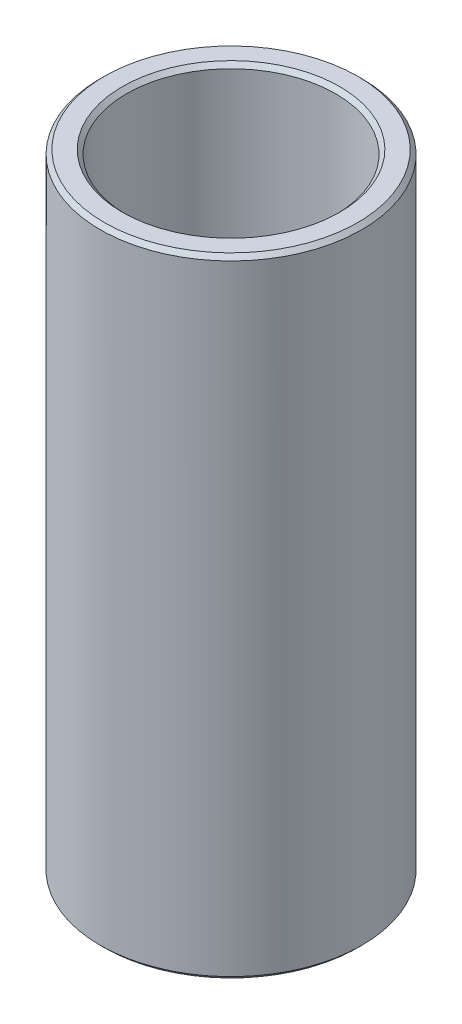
ISO-10303-21;
HEADER;
FILE_DESCRIPTION(('STEP AP214'),'2;1');
FILE_NAME('part.step','',(''),(''),'','','');
FILE_SCHEMA(('AUTOMOTIVE_DESIGN { 1 0 10303 214 1 1 1 1 }'));
ENDSEC;
DATA;
#1=APPLICATION_CONTEXT('core data for automotive mechanical design processes');
#2=APPLICATION_PROTOCOL_DEFINITION('international standard','automotive_design',2000,#1);
#3=PRODUCT_CONTEXT('',#1,'mechanical');
#4=PRODUCT('Part','Part','',(#3));
#5=PRODUCT_RELATED_PRODUCT_CATEGORY('part','',(#4));
#6=PRODUCT_DEFINITION_FORMATION('','',#4);
#7=PRODUCT_DEFINITION_CONTEXT('part definition',#1,'design');
#8=PRODUCT_DEFINITION('design','',#6,#7);
#9=PRODUCT_DEFINITION_SHAPE('','',#8);
#10=(LENGTH_UNIT() NAMED_UNIT(*) SI_UNIT(.MILLI.,.METRE.));
#11=(NAMED_UNIT(*) PLANE_ANGLE_UNIT() SI_UNIT($,.RADIAN.));
#12=(NAMED_UNIT(*) SI_UNIT($,.STERADIAN.) SOLID_ANGLE_UNIT());
#13=UNCERTAINTY_MEASURE_WITH_UNIT(LENGTH_MEASURE(1.E-05),#10,'distance_accuracy_value','');
#14=(GEOMETRIC_REPRESENTATION_CONTEXT(3) GLOBAL_UNCERTAINTY_ASSIGNED_CONTEXT((#13)) GLOBAL_UNIT_ASSIGNED_CONTEXT((#10,
#11,#12)) REPRESENTATION_CONTEXT('',''));
#15=CARTESIAN_POINT('',(0.,0.,0.));
#16=DIRECTION('',(0.,0.,1.));
#17=DIRECTION('',(1.,0.,0.));
#18=AXIS2_PLACEMENT_3D('',#15,#16,#17);
#19=CARTESIAN_POINT('',(0.,38.1,0.));
#20=DIRECTION('',(0.,1.,0.));
#21=DIRECTION('',(0.,0.,1.));
#22=AXIS2_PLACEMENT_3D('',#19,#20,#21);
#23=PLANE('',#22);
#24=CARTESIAN_POINT('',(0.,38.1,0.));
#25=DIRECTION('',(0.,1.,0.));
#26=DIRECTION('',(0.,0.,1.));
#27=AXIS2_PLACEMENT_3D('',#24,#25,#26);
#28=CIRCLE('',#27,6.60000000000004);
#29=CARTESIAN_POINT('',(0.,38.1,6.60000000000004));
#30=VERTEX_POINT('',#29);
#31=EDGE_CURVE('E10',#30,#30,#28,.F.);
#32=ORIENTED_EDGE('',*,*,#31,.T.);
#33=EDGE_LOOP('',(#32));
#34=FACE_BOUND('',#33,.T.);
#35=CARTESIAN_POINT('',(0.,38.1,0.));
#36=DIRECTION('',(0.,1.,0.));
#37=DIRECTION('',(0.,0.,1.));
#38=AXIS2_PLACEMENT_3D('',#35,#36,#37);
#39=CIRCLE('',#38,7.68750000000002);
#40=CARTESIAN_POINT('',(0.,38.1,7.68750000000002));
#41=VERTEX_POINT('',#40);
#42=EDGE_CURVE('E37',#41,#41,#39,.T.);
#43=ORIENTED_EDGE('',*,*,#42,.T.);
#44=EDGE_LOOP('',(#43));
#45=FACE_BOUND('',#44,.T.);
#46=ADVANCED_FACE('F30',(#34,#45),#23,.T.);
#47=CARTESIAN_POINT('',(0.,0.,0.));
#48=DIRECTION('',(0.,1.,0.));
#49=DIRECTION('',(0.,0.,1.));
#50=AXIS2_PLACEMENT_3D('',#47,#48,#49);
#51=PLANE('',#50);
#52=CARTESIAN_POINT('',(0.,0.,0.));
#53=DIRECTION('',(0.,1.,0.));
#54=DIRECTION('',(0.,0.,1.));
#55=AXIS2_PLACEMENT_3D('',#52,#53,#54);
#56=CIRCLE('',#55,6.59999999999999);
#57=CARTESIAN_POINT('',(0.,0.,6.59999999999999));
#58=VERTEX_POINT('',#57);
#59=EDGE_CURVE('E56',#58,#58,#56,.T.);
#60=ORIENTED_EDGE('',*,*,#59,.T.);
#61=EDGE_LOOP('',(#60));
#62=FACE_BOUND('',#61,.T.);
#63=CARTESIAN_POINT('',(0.,0.,0.));
#64=DIRECTION('',(0.,1.,0.));
#65=DIRECTION('',(0.,0.,1.));
#66=AXIS2_PLACEMENT_3D('',#63,#64,#65);
#67=CIRCLE('',#66,7.68749999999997);
#68=CARTESIAN_POINT('',(0.,0.,7.68749999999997));
#69=VERTEX_POINT('',#68);
#70=EDGE_CURVE('E59',#69,#69,#67,.F.);
#71=ORIENTED_EDGE('',*,*,#70,.T.);
#72=EDGE_LOOP('',(#71));
#73=FACE_BOUND('',#72,.T.);
#74=ADVANCED_FACE('F63',(#62,#73),#51,.F.);
#75=CARTESIAN_POINT('',(0.,38.1,0.));
#76=DIRECTION('',(0.,-1.,0.));
#77=DIRECTION('',(0.,0.,-1.));
#78=AXIS2_PLACEMENT_3D('',#75,#76,#77);
#79=CYLINDRICAL_SURFACE('',#78,7.9375);
#80=CARTESIAN_POINT('',(0.,0.250000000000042,0.));
#81=DIRECTION('',(0.,1.,0.));
#82=DIRECTION('',(0.,0.,1.));
#83=AXIS2_PLACEMENT_3D('',#80,#81,#82);
#84=CIRCLE('',#83,7.9375);
#85=CARTESIAN_POINT('',(0.,0.250000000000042,-7.9375));
#86=VERTEX_POINT('',#85);
#87=EDGE_CURVE('E41',#86,#86,#84,.T.);
#88=CARTESIAN_POINT('',(0.,37.85,0.));
#89=DIRECTION('',(0.,1.,0.));
#90=DIRECTION('',(0.,0.,1.));
#91=AXIS2_PLACEMENT_3D('',#88,#89,#90);
#92=CIRCLE('',#91,7.9375);
#93=CARTESIAN_POINT('',(0.,37.85,-7.9375));
#94=VERTEX_POINT('',#93);
#95=EDGE_CURVE('E45',#94,#94,#92,.F.);
#96=CARTESIAN_POINT('',(0.,0.250000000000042,-7.9375));
#97=CARTESIAN_POINT('',(0.,0.641666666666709,-7.9375));
#98=CARTESIAN_POINT('',(0.,1.03333333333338,-7.9375));
#99=CARTESIAN_POINT('',(0.,1.81666666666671,-7.9375));
#100=CARTESIAN_POINT('',(0.,2.20833333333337,-7.9375));
#101=CARTESIAN_POINT('',(0.,2.99166666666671,-7.9375));
#102=CARTESIAN_POINT('',(0.,3.38333333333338,-7.9375));
#103=CARTESIAN_POINT('',(0.,4.16666666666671,-7.9375));
#104=CARTESIAN_POINT('',(0.,4.55833333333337,-7.9375));
#105=CARTESIAN_POINT('',(0.,5.34166666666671,-7.9375));
#106=CARTESIAN_POINT('',(0.,5.73333333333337,-7.9375));
#107=CARTESIAN_POINT('',(0.,6.51666666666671,-7.9375));
#108=CARTESIAN_POINT('',(0.,6.90833333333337,-7.9375));
#109=CARTESIAN_POINT('',(0.,7.6916666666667,-7.9375));
#110=CARTESIAN_POINT('',(0.,8.08333333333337,-7.9375));
#111=CARTESIAN_POINT('',(0.,8.8666666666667,-7.9375));
#112=CARTESIAN_POINT('',(0.,9.25833333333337,-7.9375));
#113=CARTESIAN_POINT('',(0.,10.0416666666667,-7.9375));
#114=CARTESIAN_POINT('',(0.,10.4333333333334,-7.9375));
#115=CARTESIAN_POINT('',(0.,11.2166666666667,-7.9375));
#116=CARTESIAN_POINT('',(0.,11.6083333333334,-7.9375));
#117=CARTESIAN_POINT('',(0.,12.3916666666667,-7.9375));
#118=CARTESIAN_POINT('',(0.,12.7833333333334,-7.9375));
#119=CARTESIAN_POINT('',(0.,13.5666666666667,-7.9375));
#120=CARTESIAN_POINT('',(0.,13.9583333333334,-7.9375));
#121=CARTESIAN_POINT('',(0.,14.7416666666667,-7.9375));
#122=CARTESIAN_POINT('',(0.,15.1333333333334,-7.9375));
#123=CARTESIAN_POINT('',(0.,15.9166666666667,-7.9375));
#124=CARTESIAN_POINT('',(0.,16.3083333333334,-7.9375));
#125=CARTESIAN_POINT('',(0.,17.0916666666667,-7.9375));
#126=CARTESIAN_POINT('',(0.,17.4833333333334,-7.9375));
#127=CARTESIAN_POINT('',(0.,18.2666666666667,-7.9375));
#128=CARTESIAN_POINT('',(0.,18.6583333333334,-7.9375));
#129=CARTESIAN_POINT('',(0.,19.4416666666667,-7.9375));
#130=CARTESIAN_POINT('',(0.,19.8333333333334,-7.9375));
#131=CARTESIAN_POINT('',(0.,20.6166666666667,-7.9375));
#132=CARTESIAN_POINT('',(0.,21.0083333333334,-7.9375));
#133=CARTESIAN_POINT('',(0.,21.7916666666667,-7.9375));
#134=CARTESIAN_POINT('',(0.,22.1833333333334,-7.9375));
#135=CARTESIAN_POINT('',(0.,22.9666666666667,-7.9375));
#136=CARTESIAN_POINT('',(0.,23.3583333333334,-7.9375));
#137=CARTESIAN_POINT('',(0.,24.1416666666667,-7.9375));
#138=CARTESIAN_POINT('',(0.,24.5333333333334,-7.9375));
#139=CARTESIAN_POINT('',(0.,25.3166666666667,-7.9375));
#140=CARTESIAN_POINT('',(0.,25.7083333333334,-7.9375));
#141=CARTESIAN_POINT('',(0.,26.4916666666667,-7.9375));
#142=CARTESIAN_POINT('',(0.,26.8833333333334,-7.9375));
#143=CARTESIAN_POINT('',(0.,27.6666666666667,-7.9375));
#144=CARTESIAN_POINT('',(0.,28.0583333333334,-7.9375));
#145=CARTESIAN_POINT('',(0.,28.8416666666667,-7.9375));
#146=CARTESIAN_POINT('',(0.,29.2333333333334,-7.9375));
#147=CARTESIAN_POINT('',(0.,30.0166666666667,-7.9375));
#148=CARTESIAN_POINT('',(0.,30.4083333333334,-7.9375));
#149=CARTESIAN_POINT('',(0.,31.1916666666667,-7.9375));
#150=CARTESIAN_POINT('',(0.,31.5833333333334,-7.9375));
#151=CARTESIAN_POINT('',(0.,32.3666666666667,-7.9375));
#152=CARTESIAN_POINT('',(0.,32.7583333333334,-7.9375));
#153=CARTESIAN_POINT('',(0.,33.5416666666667,-7.9375));
#154=CARTESIAN_POINT('',(0.,33.9333333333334,-7.9375));
#155=CARTESIAN_POINT('',(0.,34.7166666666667,-7.9375));
#156=CARTESIAN_POINT('',(0.,35.1083333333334,-7.9375));
#157=CARTESIAN_POINT('',(0.,35.8916666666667,-7.9375));
#158=CARTESIAN_POINT('',(0.,36.2833333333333,-7.9375));
#159=CARTESIAN_POINT('',(0.,37.0666666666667,-7.9375));
#160=CARTESIAN_POINT('',(0.,37.4583333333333,-7.9375));
#161=CARTESIAN_POINT('',(0.,37.85,-7.9375));
#162=B_SPLINE_CURVE_WITH_KNOTS('',3,(#96,#97,#98,#99,#100,#101,#102,#103,#104,#105,#106,#107,
#108,#109,#110,#111,#112,#113,#114,#115,#116,#117,#118,#119,#120,#121,#122,#123,#124,#125,#126,
#127,#128,#129,#130,#131,#132,#133,#134,#135,#136,#137,#138,#139,#140,#141,#142,#143,#144,#145,
#146,#147,#148,#149,#150,#151,#152,#153,#154,#155,#156,#157,#158,#159,#160,#161),.UNSPECIFIED.,
.F.,.F.,(4,2,2,2,2,2,2,2,2,2,2,2,2,2,2,2,2,2,2,2,2,2,2,2,2,2,2,2,2,2,2,2,4),(0.,1.175,2.35,
3.525,4.7,5.875,7.04999999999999,8.22499999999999,9.39999999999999,10.575,11.75,12.925,14.1,
15.275,16.45,17.625,18.8,19.975,21.15,22.325,23.5,24.675,25.85,27.025,28.2,29.375,30.55,31.725,
32.9,34.075,35.25,36.425,37.6),.UNSPECIFIED.);
#163=EDGE_CURVE('BSEAM73',#86,#94,#162,.T.);
#164=ORIENTED_EDGE('',*,*,#87,.T.);
#165=ORIENTED_EDGE('',*,*,#95,.T.);
#166=ORIENTED_EDGE('',*,*,#163,.T.);
#167=ORIENTED_EDGE('',*,*,#163,.F.);
#168=EDGE_LOOP('',(#164,#166,#165,#167));
#169=FACE_BOUND('',#168,.T.);
#170=ADVANCED_FACE('F73',(#169),#79,.T.);
#171=CARTESIAN_POINT('',(0.,38.1,0.));
#172=DIRECTION('',(0.,-1.,0.));
#173=DIRECTION('',(0.,0.,-1.));
#174=AXIS2_PLACEMENT_3D('',#171,#172,#173);
#175=CYLINDRICAL_SURFACE('',#174,6.35);
#176=CARTESIAN_POINT('',(0.,0.249999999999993,0.));
#177=DIRECTION('',(0.,1.,0.));
#178=DIRECTION('',(0.,0.,1.));
#179=AXIS2_PLACEMENT_3D('',#176,#177,#178);
#180=CIRCLE('',#179,6.35);
#181=CARTESIAN_POINT('',(0.,0.249999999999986,-6.35));
#182=VERTEX_POINT('',#181);
#183=EDGE_CURVE('E50',#182,#182,#180,.F.);
#184=CARTESIAN_POINT('',(0.,37.85,0.));
#185=DIRECTION('',(0.,1.,0.));
#186=DIRECTION('',(0.,0.,1.));
#187=AXIS2_PLACEMENT_3D('',#184,#185,#186);
#188=CIRCLE('',#187,6.35);
#189=CARTESIAN_POINT('',(0.,37.85,-6.35));
#190=VERTEX_POINT('',#189);
#191=EDGE_CURVE('E53',#190,#190,#188,.T.);
#192=CARTESIAN_POINT('',(0.,0.249999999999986,-6.35));
#193=CARTESIAN_POINT('',(0.,0.641666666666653,-6.35));
#194=CARTESIAN_POINT('',(0.,1.03333333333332,-6.35));
#195=CARTESIAN_POINT('',(0.,1.81666666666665,-6.35));
#196=CARTESIAN_POINT('',(0.,2.20833333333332,-6.35));
#197=CARTESIAN_POINT('',(0.,2.99166666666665,-6.35));
#198=CARTESIAN_POINT('',(0.,3.38333333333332,-6.35));
#199=CARTESIAN_POINT('',(0.,4.16666666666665,-6.35));
#200=CARTESIAN_POINT('',(0.,4.55833333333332,-6.35));
#201=CARTESIAN_POINT('',(0.,5.34166666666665,-6.35));
#202=CARTESIAN_POINT('',(0.,5.73333333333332,-6.35));
#203=CARTESIAN_POINT('',(0.,6.51666666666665,-6.35));
#204=CARTESIAN_POINT('',(0.,6.90833333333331,-6.35));
#205=CARTESIAN_POINT('',(0.,7.69166666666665,-6.35));
#206=CARTESIAN_POINT('',(0.,8.08333333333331,-6.35));
#207=CARTESIAN_POINT('',(0.,8.86666666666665,-6.35));
#208=CARTESIAN_POINT('',(0.,9.25833333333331,-6.35));
#209=CARTESIAN_POINT('',(0.,10.0416666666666,-6.35));
#210=CARTESIAN_POINT('',(0.,10.4333333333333,-6.35));
#211=CARTESIAN_POINT('',(0.,11.2166666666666,-6.35));
#212=CARTESIAN_POINT('',(0.,11.6083333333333,-6.35));
#213=CARTESIAN_POINT('',(0.,12.3916666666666,-6.35));
#214=CARTESIAN_POINT('',(0.,12.7833333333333,-6.35));
#215=CARTESIAN_POINT('',(0.,13.5666666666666,-6.35));
#216=CARTESIAN_POINT('',(0.,13.9583333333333,-6.35));
#217=CARTESIAN_POINT('',(0.,14.7416666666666,-6.35));
#218=CARTESIAN_POINT('',(0.,15.1333333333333,-6.35));
#219=CARTESIAN_POINT('',(0.,15.9166666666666,-6.35));
#220=CARTESIAN_POINT('',(0.,16.3083333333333,-6.35));
#221=CARTESIAN_POINT('',(0.,17.0916666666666,-6.35));
#222=CARTESIAN_POINT('',(0.,17.4833333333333,-6.35));
#223=CARTESIAN_POINT('',(0.,18.2666666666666,-6.35));
#224=CARTESIAN_POINT('',(0.,18.6583333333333,-6.35));
#225=CARTESIAN_POINT('',(0.,19.4416666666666,-6.35));
#226=CARTESIAN_POINT('',(0.,19.8333333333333,-6.35));
#227=CARTESIAN_POINT('',(0.,20.6166666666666,-6.35));
#228=CARTESIAN_POINT('',(0.,21.0083333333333,-6.35));
#229=CARTESIAN_POINT('',(0.,21.7916666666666,-6.35));
#230=CARTESIAN_POINT('',(0.,22.1833333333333,-6.35));
#231=CARTESIAN_POINT('',(0.,22.9666666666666,-6.35));
#232=CARTESIAN_POINT('',(0.,23.3583333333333,-6.35));
#233=CARTESIAN_POINT('',(0.,24.1416666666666,-6.35));
#234=CARTESIAN_POINT('',(0.,24.5333333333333,-6.35));
#235=CARTESIAN_POINT('',(0.,25.3166666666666,-6.35));
#236=CARTESIAN_POINT('',(0.,25.7083333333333,-6.35));
#237=CARTESIAN_POINT('',(0.,26.4916666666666,-6.35));
#238=CARTESIAN_POINT('',(0.,26.8833333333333,-6.35));
#239=CARTESIAN_POINT('',(0.,27.6666666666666,-6.35));
#240=CARTESIAN_POINT('',(0.,28.0583333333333,-6.35));
#241=CARTESIAN_POINT('',(0.,28.8416666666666,-6.35));
#242=CARTESIAN_POINT('',(0.,29.2333333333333,-6.35));
#243=CARTESIAN_POINT('',(0.,30.0166666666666,-6.35));
#244=CARTESIAN_POINT('',(0.,30.4083333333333,-6.35));
#245=CARTESIAN_POINT('',(0.,31.1916666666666,-6.35));
#246=CARTESIAN_POINT('',(0.,31.5833333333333,-6.35));
#247=CARTESIAN_POINT('',(0.,32.3666666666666,-6.35));
#248=CARTESIAN_POINT('',(0.,32.7583333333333,-6.35));
#249=CARTESIAN_POINT('',(0.,33.5416666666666,-6.35));
#250=CARTESIAN_POINT('',(0.,33.9333333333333,-6.35));
#251=CARTESIAN_POINT('',(0.,34.7166666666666,-6.35));
#252=CARTESIAN_POINT('',(0.,35.1083333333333,-6.35));
#253=CARTESIAN_POINT('',(0.,35.8916666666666,-6.35));
#254=CARTESIAN_POINT('',(0.,36.2833333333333,-6.35));
#255=CARTESIAN_POINT('',(0.,37.0666666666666,-6.35));
#256=CARTESIAN_POINT('',(0.,37.4583333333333,-6.35));
#257=CARTESIAN_POINT('',(0.,37.85,-6.35));
#258=B_SPLINE_CURVE_WITH_KNOTS('',3,(#192,#193,#194,#195,#196,#197,#198,#199,#200,#201,#202,
#203,#204,#205,#206,#207,#208,#209,#210,#211,#212,#213,#214,#215,#216,#217,#218,#219,#220,#221,
#222,#223,#224,#225,#226,#227,#228,#229,#230,#231,#232,#233,#234,#235,#236,#237,#238,#239,#240,
#241,#242,#243,#244,#245,#246,#247,#248,#249,#250,#251,#252,#253,#254,#255,#256,#257),
.UNSPECIFIED.,.F.,.F.,(4,2,2,2,2,2,2,2,2,2,2,2,2,2,2,2,2,2,2,2,2,2,2,2,2,2,2,2,2,2,2,2,4),(0.,
1.175,2.35,3.525,4.7,5.875,7.04999999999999,8.22499999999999,9.39999999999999,10.575,11.75,
12.925,14.1,15.275,16.45,17.625,18.8,19.975,21.15,22.325,23.5,24.675,25.85,27.025,28.2,29.375,
30.55,31.725,32.9,34.075,35.25,36.425,37.6),.UNSPECIFIED.);
#259=EDGE_CURVE('BSEAM76',#182,#190,#258,.T.);
#260=ORIENTED_EDGE('',*,*,#183,.T.);
#261=ORIENTED_EDGE('',*,*,#191,.T.);
#262=ORIENTED_EDGE('',*,*,#259,.T.);
#263=ORIENTED_EDGE('',*,*,#259,.F.);
#264=EDGE_LOOP('',(#260,#262,#261,#263));
#265=FACE_BOUND('',#264,.T.);
#266=ADVANCED_FACE('F76',(#265),#175,.F.);
#267=CARTESIAN_POINT('',(0.,0.,0.));
#268=DIRECTION('',(0.,-1.,0.));
#269=DIRECTION('',(0.,0.,-1.));
#270=AXIS2_PLACEMENT_3D('',#267,#268,#269);
#271=CONICAL_SURFACE('',#270,6.59999999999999,0.785398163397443);
#272=ORIENTED_EDGE('',*,*,#183,.F.);
#273=EDGE_LOOP('',(#272));
#274=FACE_BOUND('',#273,.T.);
#275=ORIENTED_EDGE('',*,*,#59,.F.);
#276=EDGE_LOOP('',(#275));
#277=FACE_BOUND('',#276,.T.);
#278=ADVANCED_FACE('F69',(#274,#277),#271,.F.);
#279=CARTESIAN_POINT('',(0.,0.250000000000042,0.));
#280=DIRECTION('',(0.,1.,0.));
#281=DIRECTION('',(0.,0.,1.));
#282=AXIS2_PLACEMENT_3D('',#279,#280,#281);
#283=CONICAL_SURFACE('',#282,7.9375,0.785398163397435);
#284=ORIENTED_EDGE('',*,*,#70,.F.);
#285=EDGE_LOOP('',(#284));
#286=FACE_BOUND('',#285,.T.);
#287=ORIENTED_EDGE('',*,*,#87,.F.);
#288=EDGE_LOOP('',(#287));
#289=FACE_BOUND('',#288,.T.);
#290=ADVANCED_FACE('F65',(#286,#289),#283,.T.);
#291=CARTESIAN_POINT('',(0.,37.85,0.));
#292=DIRECTION('',(0.,1.,0.));
#293=DIRECTION('',(0.,0.,1.));
#294=AXIS2_PLACEMENT_3D('',#291,#292,#293);
#295=CONICAL_SURFACE('',#294,6.35,0.78539816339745);
#296=ORIENTED_EDGE('',*,*,#31,.F.);
#297=EDGE_LOOP('',(#296));
#298=FACE_BOUND('',#297,.T.);
#299=ORIENTED_EDGE('',*,*,#191,.F.);
#300=EDGE_LOOP('',(#299));
#301=FACE_BOUND('',#300,.T.);
#302=ADVANCED_FACE('F68',(#298,#301),#295,.F.);
#303=CARTESIAN_POINT('',(0.,38.1,0.));
#304=DIRECTION('',(0.,-1.,0.));
#305=DIRECTION('',(0.,0.,-1.));
#306=AXIS2_PLACEMENT_3D('',#303,#304,#305);
#307=CONICAL_SURFACE('',#306,7.68750000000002,0.785398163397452);
#308=ORIENTED_EDGE('',*,*,#95,.F.);
#309=EDGE_LOOP('',(#308));
#310=FACE_BOUND('',#309,.T.);
#311=ORIENTED_EDGE('',*,*,#42,.F.);
#312=EDGE_LOOP('',(#311));
#313=FACE_BOUND('',#312,.T.);
#314=ADVANCED_FACE('F32',(#310,#313),#307,.T.);
#315=CLOSED_SHELL('',(#46,#74,#170,#266,#278,#290,#302,#314));
#316=MANIFOLD_SOLID_BREP('B2',#315);
#317=ADVANCED_BREP_SHAPE_REPRESENTATION('',(#18,#316),#14);
#318=SHAPE_DEFINITION_REPRESENTATION(#9,#317);
ENDSEC;
END-ISO-10303-21;
